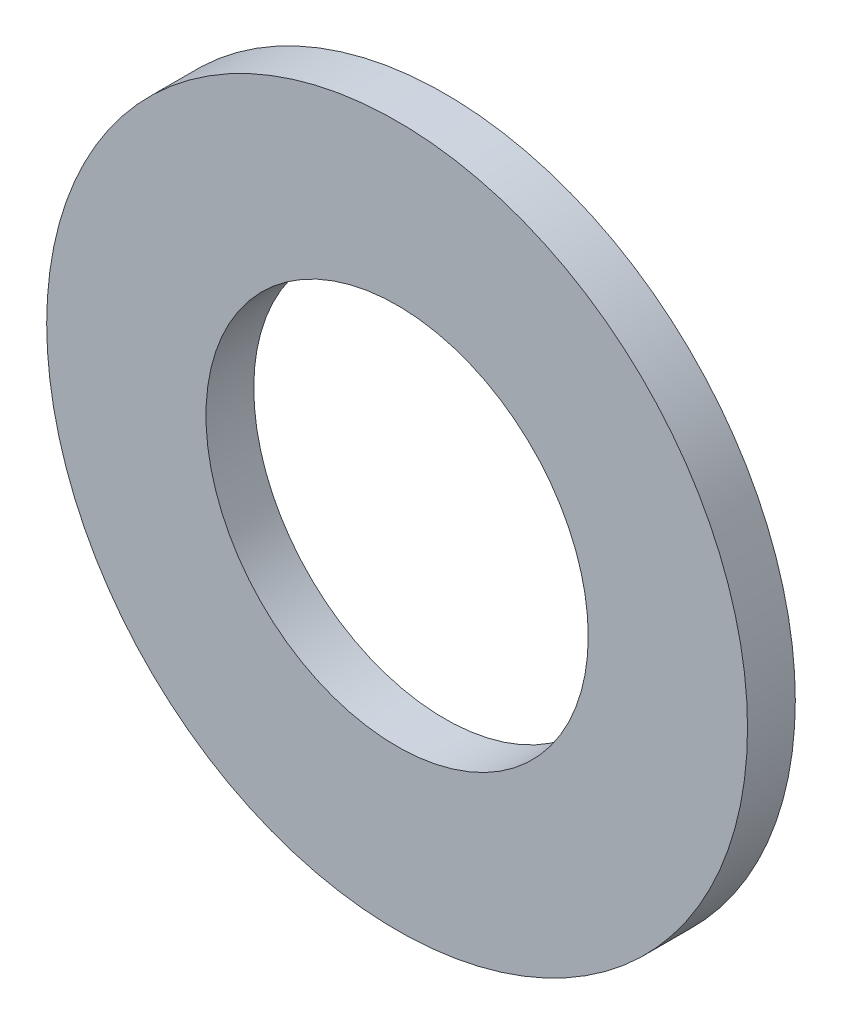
from build123d import *

# Parameters (mm, degrees)
ESQUISSE1_R      = 11
ESQUISSE1_R_2    = 6
EXTRUSION1_DEPTH = 1.5


with BuildPart() as part:
    # Esquisse1 → Extrusion1 (new body)
    with BuildSketch(Plane.XY):
        with Locations((-2, 380)):
            Circle(ESQUISSE1_R)
        with Locations((-2, 380)):
            Circle(ESQUISSE1_R_2, mode=Mode.SUBTRACT)
    extrude(amount=-EXTRUSION1_DEPTH)


solid = part.part
